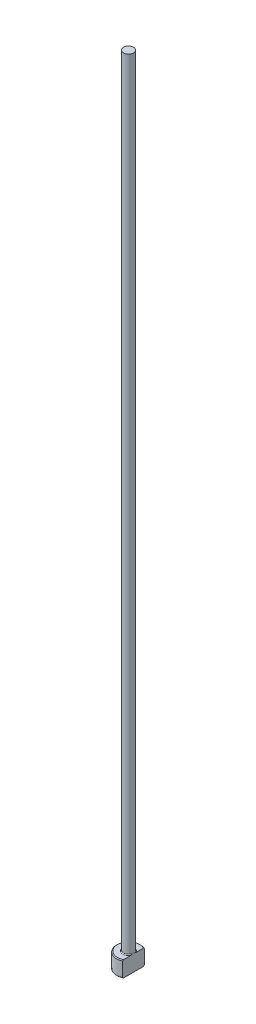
from build123d import *
from build123d.topology import SkipClean

# Parameters (mm, degrees)
CHAMFER1_SIZE    = 0.2
FILLET1_R        = 0.2
KEYED_HEAD_DEPTH = 201.044994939


with BuildPart() as part:
    # Sketch1 → Revolve1 (revolve)
    with BuildSketch(Plane.XY, mode=Mode.PRIVATE) as revolve1_sk:
        Polygon((0, 0), (-3, 0), (-3, 4), (-1.25, 4), (-1.25, 200), (0, 200), align=None)
    revolve(revolve1_sk.sketch.rotate(Axis((0, 259.958771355, 0), (0, -1, 0)), 270), axis=Axis((0, 259.958771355, 0), (0, -1, 0)))

    # Chamfer1
    chamfer1_edges = [part.edges().sort_by_distance(p)[0] for p in [
        (0, 4, -3),
        (0, 0, -3),
    ]]
    chamfer(chamfer1_edges, length=CHAMFER1_SIZE)

    # Fillet1
    fillet1_edges = [part.edges().sort_by_distance(p)[0] for p in [
        (0, 4, -1.25),
    ]]
    fillet(fillet1_edges, radius=FILLET1_R)

    # Sketch2 → KEYED HEAD (cut, through all)
    with SkipClean():  # the faces are left unmerged after this step: merging them gives an invalid solid
        with BuildSketch(Plane(origin=(0, 0, 0), x_dir=(1, 0, 0), z_dir=(0, 1, 0))):
            with BuildLine():
                Line((1.25, -2.727178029), (1.25, 2.727178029))
                ThreePointArc((1.25, 2.727178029), (3, 0), (1.25, -2.727178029))
            make_face()
        extrude(amount=KEYED_HEAD_DEPTH, mode=Mode.SUBTRACT)


solid = part.part
